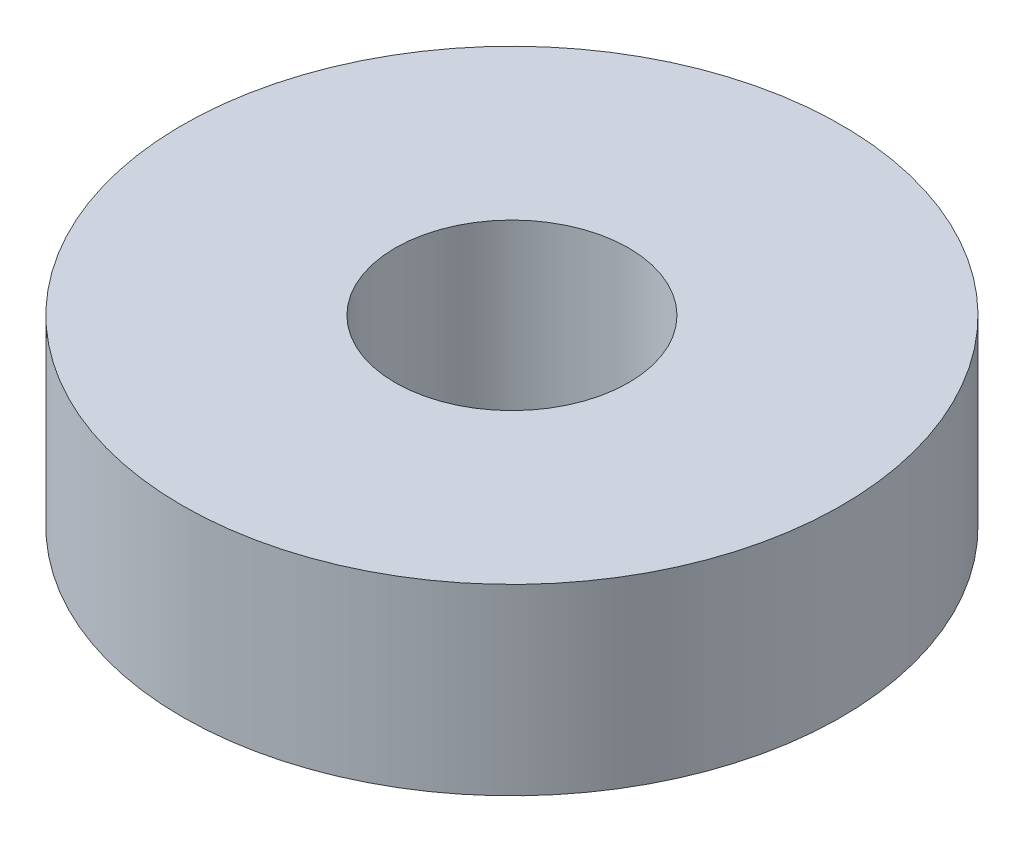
from build123d import *

# Parameters (mm, degrees)
SKETCH1_R           = 9.144
SKETCH1_R_2         = 3.2385
BOSS_EXTRUDE1_DEPTH = 5.08


with BuildPart() as part:
    # Sketch1 → Boss-Extrude1 (new body)
    with BuildSketch(Plane(origin=(0, 0, 0), x_dir=(1, 0, 0), z_dir=(0, 1, 0))):
        with Locations(Location((0, 0, 0), (0, 0, 270))):
            Circle(SKETCH1_R)
        with Locations(Location((0, 0, 0), (0, 0, 270))):
            Circle(SKETCH1_R_2, mode=Mode.SUBTRACT)
    extrude(amount=BOSS_EXTRUDE1_DEPTH)


solid = part.part
